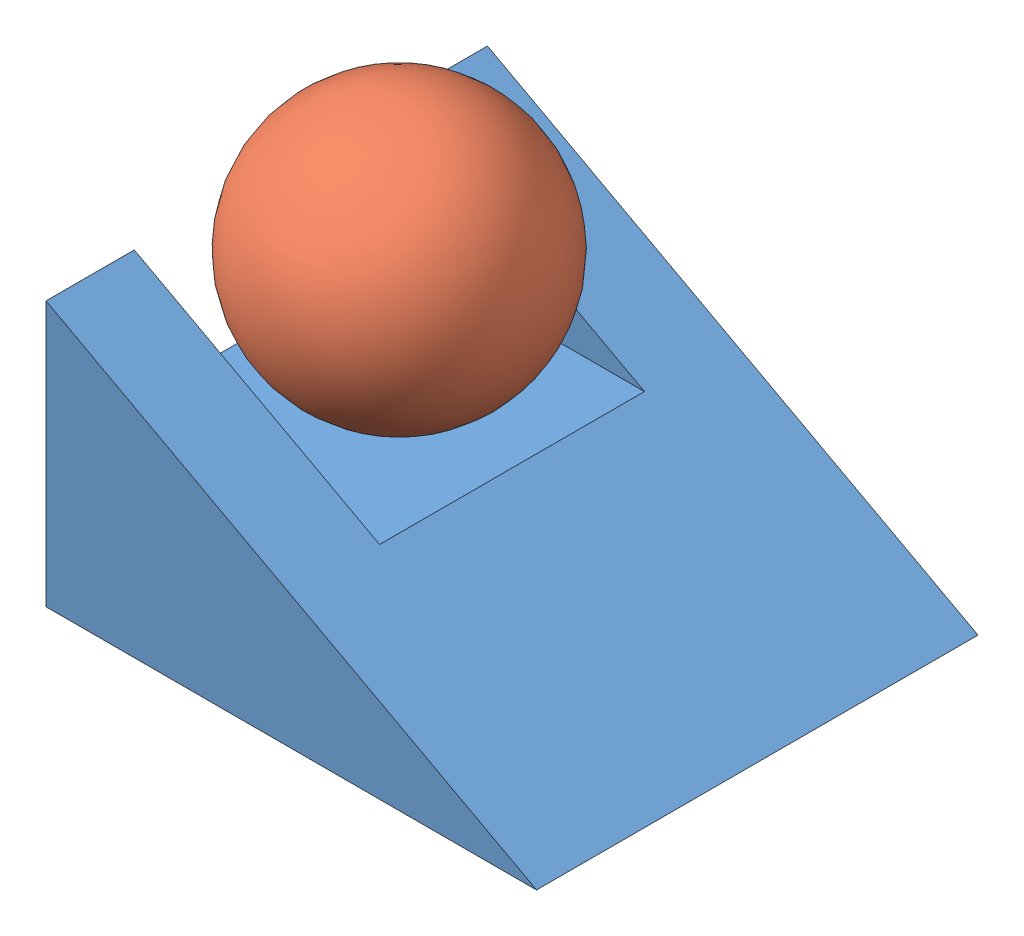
SolidWorks assembly Assemblage1.sldasm, configuration Défaut (file format 3100). Lengths in mm.
Overall size (50 40.5 45).
2 component instances, 2 part files, 3 mates.
Components (placement in the parent):
- prisme_futur-1: prisme_futur.SLDPRT [Défaut] at (-15.3908 -14.0294 0) size (50 27 45)
- boule_futur-1: boule_futur.SLDPRT [Défaut] at (-1.8908 12.9706 22.5) size (27 27 27)
Mates (geometry in assembly coordinates):
- Tangent1: tangent aligned: plane of prisme_futur-1; sphere of boule_futur-1
- Tangent2: tangent anti-aligned: plane of prisme_futur-1; sphere of boule_futur-1
- Tangent3: tangent anti-aligned: plane of prisme_futur-1; sphere of boule_futur-1
